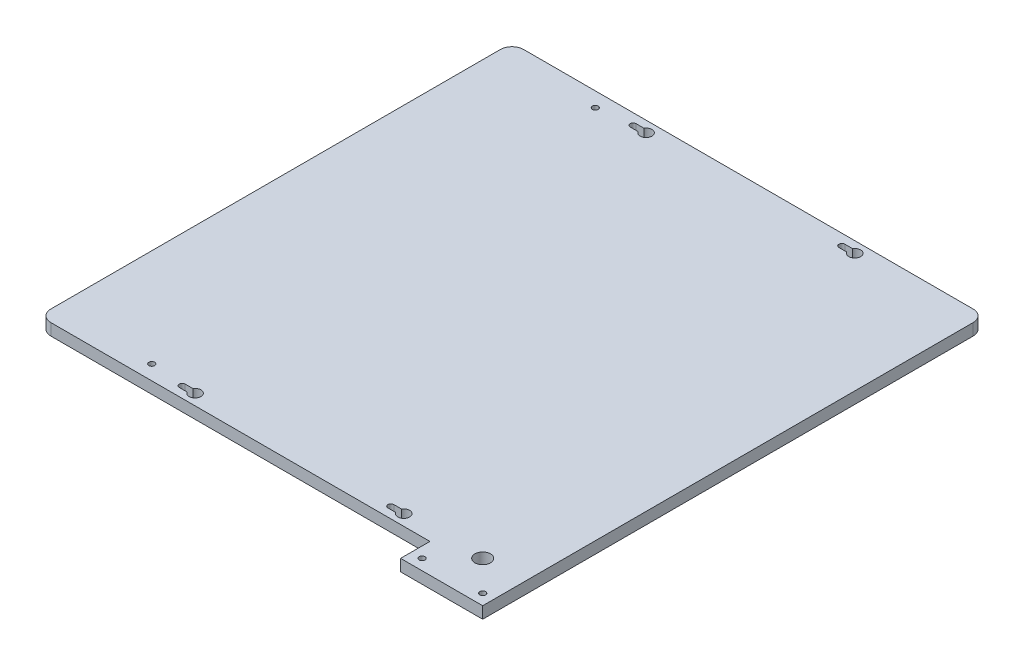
ISO-10303-21;
HEADER;
FILE_DESCRIPTION(('STEP AP214'),'2;1');
FILE_NAME('part.step','',(''),(''),'','','');
FILE_SCHEMA(('AUTOMOTIVE_DESIGN { 1 0 10303 214 1 1 1 1 }'));
ENDSEC;
DATA;
#1=APPLICATION_CONTEXT('core data for automotive mechanical design processes');
#2=APPLICATION_PROTOCOL_DEFINITION('international standard','automotive_design',2000,#1);
#3=PRODUCT_CONTEXT('',#1,'mechanical');
#4=PRODUCT('Part','Part','',(#3));
#5=PRODUCT_RELATED_PRODUCT_CATEGORY('part','',(#4));
#6=PRODUCT_DEFINITION_FORMATION('','',#4);
#7=PRODUCT_DEFINITION_CONTEXT('part definition',#1,'design');
#8=PRODUCT_DEFINITION('design','',#6,#7);
#9=PRODUCT_DEFINITION_SHAPE('','',#8);
#10=(LENGTH_UNIT() NAMED_UNIT(*) SI_UNIT(.MILLI.,.METRE.));
#11=(NAMED_UNIT(*) PLANE_ANGLE_UNIT() SI_UNIT($,.RADIAN.));
#12=(NAMED_UNIT(*) SI_UNIT($,.STERADIAN.) SOLID_ANGLE_UNIT());
#13=UNCERTAINTY_MEASURE_WITH_UNIT(LENGTH_MEASURE(1.E-05),#10,'distance_accuracy_value','');
#14=(GEOMETRIC_REPRESENTATION_CONTEXT(3) GLOBAL_UNCERTAINTY_ASSIGNED_CONTEXT((#13)) GLOBAL_UNIT_ASSIGNED_CONTEXT((#10,
#11,#12)) REPRESENTATION_CONTEXT('',''));
#15=CARTESIAN_POINT('',(0.,0.,0.));
#16=DIRECTION('',(0.,0.,1.));
#17=DIRECTION('',(1.,0.,0.));
#18=AXIS2_PLACEMENT_3D('',#15,#16,#17);
#19=CARTESIAN_POINT('',(0.,-3.,0.));
#20=DIRECTION('',(0.,1.,0.));
#21=DIRECTION('',(0.,0.,1.));
#22=AXIS2_PLACEMENT_3D('',#19,#20,#21);
#23=PLANE('',#22);
#24=DIRECTION('',(1.,0.,0.));
#25=VECTOR('',#24,1.);
#26=CARTESIAN_POINT('',(53.4,-3.,116.9));
#27=LINE('',#26,#25);
#28=CARTESIAN_POINT('',(53.4,-3.,116.9));
#29=VERTEX_POINT('',#28);
#30=CARTESIAN_POINT('',(57.4019237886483,-3.,116.9));
#31=VERTEX_POINT('',#30);
#32=EDGE_CURVE('E251',#29,#31,#27,.T.);
#33=ORIENTED_EDGE('',*,*,#32,.T.);
#34=CARTESIAN_POINT('',(60.,-3.,115.4));
#35=DIRECTION('',(0.,-1.,0.));
#36=DIRECTION('',(0.,0.,-1.));
#37=AXIS2_PLACEMENT_3D('',#34,#35,#36);
#38=CIRCLE('',#37,2.99999999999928);
#39=CARTESIAN_POINT('',(57.4019237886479,-3.,113.899999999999));
#40=VERTEX_POINT('',#39);
#41=EDGE_CURVE('E774',#40,#31,#38,.T.);
#42=ORIENTED_EDGE('',*,*,#41,.F.);
#43=DIRECTION('',(-1.,0.,1.8032451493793E-13));
#44=VECTOR('',#43,1.);
#45=CARTESIAN_POINT('',(57.4019237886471,-3.,113.899999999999));
#46=LINE('',#45,#44);
#47=CARTESIAN_POINT('',(53.4,-3.,113.9));
#48=VERTEX_POINT('',#47);
#49=EDGE_CURVE('E247',#40,#48,#46,.T.);
#50=ORIENTED_EDGE('',*,*,#49,.T.);
#51=CARTESIAN_POINT('',(53.4,-3.,115.4));
#52=DIRECTION('',(0.,1.,0.));
#53=DIRECTION('',(0.,0.,1.));
#54=AXIS2_PLACEMENT_3D('',#51,#52,#53);
#55=CIRCLE('',#54,1.5);
#56=EDGE_CURVE('E260',#48,#29,#55,.T.);
#57=ORIENTED_EDGE('',*,*,#56,.T.);
#58=EDGE_LOOP('',(#33,#42,#50,#57));
#59=FACE_BOUND('',#58,.T.);
#60=DIRECTION('',(1.,0.,0.));
#61=VECTOR('',#60,1.);
#62=CARTESIAN_POINT('',(53.4,-3.,-113.9));
#63=LINE('',#62,#61);
#64=CARTESIAN_POINT('',(53.4,-3.,-113.9));
#65=VERTEX_POINT('',#64);
#66=CARTESIAN_POINT('',(57.4019237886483,-3.,-113.9));
#67=VERTEX_POINT('',#66);
#68=EDGE_CURVE('E303',#65,#67,#63,.T.);
#69=ORIENTED_EDGE('',*,*,#68,.T.);
#70=CARTESIAN_POINT('',(60.,-3.,-115.4));
#71=DIRECTION('',(0.,-1.,0.));
#72=DIRECTION('',(0.,0.,-1.));
#73=AXIS2_PLACEMENT_3D('',#70,#71,#72);
#74=CIRCLE('',#73,2.99999999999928);
#75=CARTESIAN_POINT('',(57.4019237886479,-3.,-116.900000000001));
#76=VERTEX_POINT('',#75);
#77=EDGE_CURVE('E795',#76,#67,#74,.T.);
#78=ORIENTED_EDGE('',*,*,#77,.F.);
#79=DIRECTION('',(-1.,0.,1.8032451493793E-13));
#80=VECTOR('',#79,1.);
#81=CARTESIAN_POINT('',(57.4019237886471,-3.,-116.900000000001));
#82=LINE('',#81,#80);
#83=CARTESIAN_POINT('',(53.4,-3.,-116.9));
#84=VERTEX_POINT('',#83);
#85=EDGE_CURVE('E299',#76,#84,#82,.T.);
#86=ORIENTED_EDGE('',*,*,#85,.T.);
#87=CARTESIAN_POINT('',(53.4,-3.,-115.4));
#88=DIRECTION('',(0.,1.,0.));
#89=DIRECTION('',(0.,0.,1.));
#90=AXIS2_PLACEMENT_3D('',#87,#88,#89);
#91=CIRCLE('',#90,1.5);
#92=EDGE_CURVE('E312',#84,#65,#91,.T.);
#93=ORIENTED_EDGE('',*,*,#92,.T.);
#94=EDGE_LOOP('',(#69,#78,#86,#93));
#95=FACE_BOUND('',#94,.T.);
#96=CARTESIAN_POINT('',(115.5,-3.,130.5));
#97=DIRECTION('',(0.,1.,0.));
#98=DIRECTION('',(0.,0.,1.));
#99=AXIS2_PLACEMENT_3D('',#96,#97,#98);
#100=CIRCLE('',#99,1.5);
#101=CARTESIAN_POINT('',(115.5,-3.,132.));
#102=VERTEX_POINT('',#101);
#103=EDGE_CURVE('E326',#102,#102,#100,.T.);
#104=ORIENTED_EDGE('',*,*,#103,.T.);
#105=EDGE_LOOP('',(#104));
#106=FACE_BOUND('',#105,.T.);
#107=CARTESIAN_POINT('',(84.5,-3.,130.5));
#108=DIRECTION('',(0.,1.,0.));
#109=DIRECTION('',(0.,0.,1.));
#110=AXIS2_PLACEMENT_3D('',#107,#108,#109);
#111=CIRCLE('',#110,1.5);
#112=CARTESIAN_POINT('',(84.5,-3.,132.));
#113=VERTEX_POINT('',#112);
#114=EDGE_CURVE('E329',#113,#113,#111,.T.);
#115=ORIENTED_EDGE('',*,*,#114,.T.);
#116=EDGE_LOOP('',(#115));
#117=FACE_BOUND('',#116,.T.);
#118=DIRECTION('',(-1.,0.,0.));
#119=VECTOR('',#118,1.);
#120=CARTESIAN_POINT('',(0.,-3.,-121.));
#121=LINE('',#120,#119);
#122=CARTESIAN_POINT('',(115.,-3.,-121.));
#123=VERTEX_POINT('',#122);
#124=CARTESIAN_POINT('',(-115.,-3.,-121.));
#125=VERTEX_POINT('',#124);
#126=EDGE_CURVE('E335',#123,#125,#121,.T.);
#127=ORIENTED_EDGE('',*,*,#126,.F.);
#128=CARTESIAN_POINT('',(115.,-3.,-115.));
#129=DIRECTION('',(0.,1.,0.));
#130=DIRECTION('',(0.,0.,1.));
#131=AXIS2_PLACEMENT_3D('',#128,#129,#130);
#132=CIRCLE('',#131,6.);
#133=CARTESIAN_POINT('',(121.,-3.,-115.));
#134=VERTEX_POINT('',#133);
#135=EDGE_CURVE('E410',#123,#134,#132,.F.);
#136=ORIENTED_EDGE('',*,*,#135,.T.);
#137=DIRECTION('',(0.,0.,1.));
#138=VECTOR('',#137,1.);
#139=CARTESIAN_POINT('',(121.,-3.,0.));
#140=LINE('',#139,#138);
#141=CARTESIAN_POINT('',(121.,-3.,136.));
#142=VERTEX_POINT('',#141);
#143=EDGE_CURVE('E333',#134,#142,#140,.T.);
#144=ORIENTED_EDGE('',*,*,#143,.T.);
#145=DIRECTION('',(-1.,0.,0.));
#146=VECTOR('',#145,1.);
#147=CARTESIAN_POINT('',(0.,-3.,136.));
#148=LINE('',#147,#146);
#149=CARTESIAN_POINT('',(79.,-3.,136.));
#150=VERTEX_POINT('',#149);
#151=EDGE_CURVE('E345',#142,#150,#148,.T.);
#152=ORIENTED_EDGE('',*,*,#151,.T.);
#153=DIRECTION('',(0.,0.,1.));
#154=VECTOR('',#153,1.);
#155=CARTESIAN_POINT('',(78.9999999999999,-3.,0.));
#156=LINE('',#155,#154);
#157=CARTESIAN_POINT('',(79.,-3.,121.));
#158=VERTEX_POINT('',#157);
#159=EDGE_CURVE('E342',#158,#150,#156,.T.);
#160=ORIENTED_EDGE('',*,*,#159,.F.);
#161=DIRECTION('',(1.,0.,0.));
#162=VECTOR('',#161,1.);
#163=CARTESIAN_POINT('',(0.,-3.,121.));
#164=LINE('',#163,#162);
#165=CARTESIAN_POINT('',(-115.,-3.,121.));
#166=VERTEX_POINT('',#165);
#167=EDGE_CURVE('E340',#166,#158,#164,.T.);
#168=ORIENTED_EDGE('',*,*,#167,.F.);
#169=CARTESIAN_POINT('',(-115.,-3.,115.));
#170=DIRECTION('',(0.,1.,0.));
#171=DIRECTION('',(0.,0.,1.));
#172=AXIS2_PLACEMENT_3D('',#169,#170,#171);
#173=CIRCLE('',#172,6.);
#174=CARTESIAN_POINT('',(-121.,-3.,115.));
#175=VERTEX_POINT('',#174);
#176=EDGE_CURVE('E52',#166,#175,#173,.F.);
#177=ORIENTED_EDGE('',*,*,#176,.T.);
#178=DIRECTION('',(0.,0.,1.));
#179=VECTOR('',#178,1.);
#180=CARTESIAN_POINT('',(-121.,-3.,0.));
#181=LINE('',#180,#179);
#182=CARTESIAN_POINT('',(-121.,-3.,-115.));
#183=VERTEX_POINT('',#182);
#184=EDGE_CURVE('E338',#183,#175,#181,.T.);
#185=ORIENTED_EDGE('',*,*,#184,.F.);
#186=CARTESIAN_POINT('',(-115.,-3.,-115.));
#187=DIRECTION('',(0.,1.,0.));
#188=DIRECTION('',(0.,0.,1.));
#189=AXIS2_PLACEMENT_3D('',#186,#187,#188);
#190=CIRCLE('',#189,6.);
#191=EDGE_CURVE('E407',#183,#125,#190,.F.);
#192=ORIENTED_EDGE('',*,*,#191,.T.);
#193=EDGE_LOOP('',(#127,#136,#144,#152,#160,#168,#177,#185,#192));
#194=FACE_BOUND('',#193,.T.);
#195=CARTESIAN_POINT('',(100.,-3.,115.));
#196=DIRECTION('',(0.,1.,0.));
#197=DIRECTION('',(0.,0.,1.));
#198=AXIS2_PLACEMENT_3D('',#195,#196,#197);
#199=CIRCLE('',#198,4.00000000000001);
#200=CARTESIAN_POINT('',(100.,-3.,119.));
#201=VERTEX_POINT('',#200);
#202=EDGE_CURVE('E347',#201,#201,#199,.T.);
#203=ORIENTED_EDGE('',*,*,#202,.T.);
#204=EDGE_LOOP('',(#203));
#205=FACE_BOUND('',#204,.T.);
#206=CARTESIAN_POINT('',(-70.85,-3.,-113.5));
#207=DIRECTION('',(0.,1.,0.));
#208=DIRECTION('',(0.,0.,1.));
#209=AXIS2_PLACEMENT_3D('',#206,#207,#208);
#210=CIRCLE('',#209,1.5);
#211=CARTESIAN_POINT('',(-70.85,-3.,-112.));
#212=VERTEX_POINT('',#211);
#213=EDGE_CURVE('E350',#212,#212,#210,.T.);
#214=ORIENTED_EDGE('',*,*,#213,.T.);
#215=EDGE_LOOP('',(#214));
#216=FACE_BOUND('',#215,.T.);
#217=CARTESIAN_POINT('',(-70.85,-3.,113.5));
#218=DIRECTION('',(0.,1.,0.));
#219=DIRECTION('',(0.,0.,1.));
#220=AXIS2_PLACEMENT_3D('',#217,#218,#219);
#221=CIRCLE('',#220,1.5);
#222=CARTESIAN_POINT('',(-70.85,-3.,115.));
#223=VERTEX_POINT('',#222);
#224=EDGE_CURVE('E353',#223,#223,#221,.T.);
#225=ORIENTED_EDGE('',*,*,#224,.T.);
#226=EDGE_LOOP('',(#225));
#227=FACE_BOUND('',#226,.T.);
#228=DIRECTION('',(1.,0.,0.));
#229=VECTOR('',#228,1.);
#230=CARTESIAN_POINT('',(-53.4,-3.,-113.9));
#231=LINE('',#230,#229);
#232=CARTESIAN_POINT('',(-53.4,-3.,-113.9));
#233=VERTEX_POINT('',#232);
#234=CARTESIAN_POINT('',(-49.3980762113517,-3.,-113.9));
#235=VERTEX_POINT('',#234);
#236=EDGE_CURVE('E277',#233,#235,#231,.T.);
#237=ORIENTED_EDGE('',*,*,#236,.T.);
#238=CARTESIAN_POINT('',(-46.8,-3.,-115.4));
#239=DIRECTION('',(0.,-1.,0.));
#240=DIRECTION('',(0.,0.,-1.));
#241=AXIS2_PLACEMENT_3D('',#238,#239,#240);
#242=CIRCLE('',#241,2.99999999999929);
#243=CARTESIAN_POINT('',(-49.3980762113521,-3.,-116.900000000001));
#244=VERTEX_POINT('',#243);
#245=EDGE_CURVE('E787',#244,#235,#242,.T.);
#246=ORIENTED_EDGE('',*,*,#245,.F.);
#247=DIRECTION('',(-1.,0.,1.8032451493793E-13));
#248=VECTOR('',#247,1.);
#249=CARTESIAN_POINT('',(-49.3980762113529,-3.,-116.900000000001));
#250=LINE('',#249,#248);
#251=CARTESIAN_POINT('',(-53.4,-3.,-116.9));
#252=VERTEX_POINT('',#251);
#253=EDGE_CURVE('E273',#244,#252,#250,.T.);
#254=ORIENTED_EDGE('',*,*,#253,.T.);
#255=CARTESIAN_POINT('',(-53.4,-3.,-115.4));
#256=DIRECTION('',(0.,1.,0.));
#257=DIRECTION('',(0.,0.,1.));
#258=AXIS2_PLACEMENT_3D('',#255,#256,#257);
#259=CIRCLE('',#258,1.5);
#260=EDGE_CURVE('E286',#252,#233,#259,.T.);
#261=ORIENTED_EDGE('',*,*,#260,.T.);
#262=EDGE_LOOP('',(#237,#246,#254,#261));
#263=FACE_BOUND('',#262,.T.);
#264=DIRECTION('',(-1.,0.,-1.8032451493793E-13));
#265=VECTOR('',#264,1.);
#266=CARTESIAN_POINT('',(-49.3980762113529,-3.,116.900000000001));
#267=LINE('',#266,#265);
#268=CARTESIAN_POINT('',(-49.3980762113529,-3.,116.900000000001));
#269=VERTEX_POINT('',#268);
#270=CARTESIAN_POINT('',(-53.4,-3.,116.9));
#271=VERTEX_POINT('',#270);
#272=EDGE_CURVE('E222',#269,#271,#267,.T.);
#273=ORIENTED_EDGE('',*,*,#272,.F.);
#274=CARTESIAN_POINT('',(-46.8,-3.,115.4));
#275=DIRECTION('',(0.,-1.,0.));
#276=DIRECTION('',(0.,0.,-1.));
#277=AXIS2_PLACEMENT_3D('',#274,#275,#276);
#278=CIRCLE('',#277,2.99999999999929);
#279=CARTESIAN_POINT('',(-49.3980762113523,-3.,113.9));
#280=VERTEX_POINT('',#279);
#281=EDGE_CURVE('E207',#280,#269,#278,.T.);
#282=ORIENTED_EDGE('',*,*,#281,.F.);
#283=DIRECTION('',(1.,0.,-1.8032451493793E-13));
#284=VECTOR('',#283,1.);
#285=CARTESIAN_POINT('',(-53.4,-3.,113.9));
#286=LINE('',#285,#284);
#287=CARTESIAN_POINT('',(-53.4,-3.,113.9));
#288=VERTEX_POINT('',#287);
#289=EDGE_CURVE('E221',#288,#280,#286,.T.);
#290=ORIENTED_EDGE('',*,*,#289,.F.);
#291=CARTESIAN_POINT('',(-53.4,-3.,115.4));
#292=DIRECTION('',(0.,-1.,0.));
#293=DIRECTION('',(0.,0.,-1.));
#294=AXIS2_PLACEMENT_3D('',#291,#292,#293);
#295=CIRCLE('',#294,1.5);
#296=EDGE_CURVE('E227',#271,#288,#295,.T.);
#297=ORIENTED_EDGE('',*,*,#296,.F.);
#298=EDGE_LOOP('',(#273,#282,#290,#297));
#299=FACE_BOUND('',#298,.T.);
#300=ADVANCED_FACE('F37',(#59,#95,#106,#117,#194,#205,#216,#227,#263,#299),#23,.F.);
#301=CARTESIAN_POINT('',(0.,3.,0.));
#302=DIRECTION('',(0.,1.,0.));
#303=DIRECTION('',(0.,0.,1.));
#304=AXIS2_PLACEMENT_3D('',#301,#302,#303);
#305=PLANE('',#304);
#306=CARTESIAN_POINT('',(-46.8,3.,115.4));
#307=DIRECTION('',(0.,-1.,0.));
#308=DIRECTION('',(0.,0.,-1.));
#309=AXIS2_PLACEMENT_3D('',#306,#307,#308);
#310=CIRCLE('',#309,2.99999999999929);
#311=CARTESIAN_POINT('',(-49.3980762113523,3.,113.9));
#312=VERTEX_POINT('',#311);
#313=CARTESIAN_POINT('',(-49.3980762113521,3.,116.900000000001));
#314=VERTEX_POINT('',#313);
#315=EDGE_CURVE('E210',#312,#314,#310,.T.);
#316=ORIENTED_EDGE('',*,*,#315,.T.);
#317=DIRECTION('',(-1.,0.,-1.8032451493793E-13));
#318=VECTOR('',#317,1.);
#319=CARTESIAN_POINT('',(-49.3980762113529,3.,116.900000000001));
#320=LINE('',#319,#318);
#321=CARTESIAN_POINT('',(-53.4,3.,116.9));
#322=VERTEX_POINT('',#321);
#323=EDGE_CURVE('E231',#314,#322,#320,.T.);
#324=ORIENTED_EDGE('',*,*,#323,.T.);
#325=CARTESIAN_POINT('',(-53.4,3.,115.4));
#326=DIRECTION('',(0.,-1.,0.));
#327=DIRECTION('',(0.,0.,-1.));
#328=AXIS2_PLACEMENT_3D('',#325,#326,#327);
#329=CIRCLE('',#328,1.5);
#330=CARTESIAN_POINT('',(-53.4,3.,113.9));
#331=VERTEX_POINT('',#330);
#332=EDGE_CURVE('E235',#322,#331,#329,.T.);
#333=ORIENTED_EDGE('',*,*,#332,.T.);
#334=DIRECTION('',(1.,0.,-1.8032451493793E-13));
#335=VECTOR('',#334,1.);
#336=CARTESIAN_POINT('',(-53.4,3.,113.9));
#337=LINE('',#336,#335);
#338=EDGE_CURVE('E238',#331,#312,#337,.T.);
#339=ORIENTED_EDGE('',*,*,#338,.T.);
#340=EDGE_LOOP('',(#316,#324,#333,#339));
#341=FACE_BOUND('',#340,.T.);
#342=CARTESIAN_POINT('',(60.,3.,115.4));
#343=DIRECTION('',(0.,-1.,0.));
#344=DIRECTION('',(0.,0.,-1.));
#345=AXIS2_PLACEMENT_3D('',#342,#343,#344);
#346=CIRCLE('',#345,2.99999999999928);
#347=CARTESIAN_POINT('',(57.4019237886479,3.,113.899999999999));
#348=VERTEX_POINT('',#347);
#349=CARTESIAN_POINT('',(57.4019237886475,3.,116.9));
#350=VERTEX_POINT('',#349);
#351=EDGE_CURVE('E776',#348,#350,#346,.T.);
#352=ORIENTED_EDGE('',*,*,#351,.T.);
#353=DIRECTION('',(1.,0.,0.));
#354=VECTOR('',#353,1.);
#355=CARTESIAN_POINT('',(53.4,3.,116.9));
#356=LINE('',#355,#354);
#357=CARTESIAN_POINT('',(53.4,3.,116.9));
#358=VERTEX_POINT('',#357);
#359=EDGE_CURVE('E254',#358,#350,#356,.T.);
#360=ORIENTED_EDGE('',*,*,#359,.F.);
#361=CARTESIAN_POINT('',(53.4,3.,115.4));
#362=DIRECTION('',(0.,1.,0.));
#363=DIRECTION('',(0.,0.,1.));
#364=AXIS2_PLACEMENT_3D('',#361,#362,#363);
#365=CIRCLE('',#364,1.5);
#366=CARTESIAN_POINT('',(53.4,3.,113.9));
#367=VERTEX_POINT('',#366);
#368=EDGE_CURVE('E250',#367,#358,#365,.T.);
#369=ORIENTED_EDGE('',*,*,#368,.F.);
#370=DIRECTION('',(-1.,0.,1.8032451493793E-13));
#371=VECTOR('',#370,1.);
#372=CARTESIAN_POINT('',(57.4019237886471,3.,113.899999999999));
#373=LINE('',#372,#371);
#374=EDGE_CURVE('E248',#348,#367,#373,.T.);
#375=ORIENTED_EDGE('',*,*,#374,.F.);
#376=EDGE_LOOP('',(#352,#360,#369,#375));
#377=FACE_BOUND('',#376,.T.);
#378=CARTESIAN_POINT('',(-46.8,3.,-115.4));
#379=DIRECTION('',(0.,-1.,0.));
#380=DIRECTION('',(0.,0.,-1.));
#381=AXIS2_PLACEMENT_3D('',#378,#379,#380);
#382=CIRCLE('',#381,2.99999999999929);
#383=CARTESIAN_POINT('',(-49.3980762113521,3.,-116.900000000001));
#384=VERTEX_POINT('',#383);
#385=CARTESIAN_POINT('',(-49.3980762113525,3.,-113.9));
#386=VERTEX_POINT('',#385);
#387=EDGE_CURVE('E789',#384,#386,#382,.T.);
#388=ORIENTED_EDGE('',*,*,#387,.T.);
#389=DIRECTION('',(1.,0.,0.));
#390=VECTOR('',#389,1.);
#391=CARTESIAN_POINT('',(-53.4,3.,-113.9));
#392=LINE('',#391,#390);
#393=CARTESIAN_POINT('',(-53.4,3.,-113.9));
#394=VERTEX_POINT('',#393);
#395=EDGE_CURVE('E280',#394,#386,#392,.T.);
#396=ORIENTED_EDGE('',*,*,#395,.F.);
#397=CARTESIAN_POINT('',(-53.4,3.,-115.4));
#398=DIRECTION('',(0.,1.,0.));
#399=DIRECTION('',(0.,0.,1.));
#400=AXIS2_PLACEMENT_3D('',#397,#398,#399);
#401=CIRCLE('',#400,1.5);
#402=CARTESIAN_POINT('',(-53.4,3.,-116.9));
#403=VERTEX_POINT('',#402);
#404=EDGE_CURVE('E276',#403,#394,#401,.T.);
#405=ORIENTED_EDGE('',*,*,#404,.F.);
#406=DIRECTION('',(-1.,0.,1.8032451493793E-13));
#407=VECTOR('',#406,1.);
#408=CARTESIAN_POINT('',(-49.3980762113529,3.,-116.900000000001));
#409=LINE('',#408,#407);
#410=EDGE_CURVE('E274',#384,#403,#409,.T.);
#411=ORIENTED_EDGE('',*,*,#410,.F.);
#412=EDGE_LOOP('',(#388,#396,#405,#411));
#413=FACE_BOUND('',#412,.T.);
#414=CARTESIAN_POINT('',(60.,3.,-115.4));
#415=DIRECTION('',(0.,-1.,0.));
#416=DIRECTION('',(0.,0.,-1.));
#417=AXIS2_PLACEMENT_3D('',#414,#415,#416);
#418=CIRCLE('',#417,2.99999999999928);
#419=CARTESIAN_POINT('',(57.4019237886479,3.,-116.900000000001));
#420=VERTEX_POINT('',#419);
#421=CARTESIAN_POINT('',(57.4019237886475,3.,-113.9));
#422=VERTEX_POINT('',#421);
#423=EDGE_CURVE('E239',#420,#422,#418,.T.);
#424=ORIENTED_EDGE('',*,*,#423,.T.);
#425=DIRECTION('',(1.,0.,0.));
#426=VECTOR('',#425,1.);
#427=CARTESIAN_POINT('',(53.4,3.,-113.9));
#428=LINE('',#427,#426);
#429=CARTESIAN_POINT('',(53.4,3.,-113.9));
#430=VERTEX_POINT('',#429);
#431=EDGE_CURVE('E306',#430,#422,#428,.T.);
#432=ORIENTED_EDGE('',*,*,#431,.F.);
#433=CARTESIAN_POINT('',(53.4,3.,-115.4));
#434=DIRECTION('',(0.,1.,0.));
#435=DIRECTION('',(0.,0.,1.));
#436=AXIS2_PLACEMENT_3D('',#433,#434,#435);
#437=CIRCLE('',#436,1.5);
#438=CARTESIAN_POINT('',(53.4,3.,-116.9));
#439=VERTEX_POINT('',#438);
#440=EDGE_CURVE('E302',#439,#430,#437,.T.);
#441=ORIENTED_EDGE('',*,*,#440,.F.);
#442=DIRECTION('',(-1.,0.,1.8032451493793E-13));
#443=VECTOR('',#442,1.);
#444=CARTESIAN_POINT('',(57.4019237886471,3.,-116.900000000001));
#445=LINE('',#444,#443);
#446=EDGE_CURVE('E300',#420,#439,#445,.T.);
#447=ORIENTED_EDGE('',*,*,#446,.F.);
#448=EDGE_LOOP('',(#424,#432,#441,#447));
#449=FACE_BOUND('',#448,.T.);
#450=CARTESIAN_POINT('',(115.5,3.,130.5));
#451=DIRECTION('',(0.,1.,0.));
#452=DIRECTION('',(0.,0.,1.));
#453=AXIS2_PLACEMENT_3D('',#450,#451,#452);
#454=CIRCLE('',#453,1.5);
#455=CARTESIAN_POINT('',(115.5,3.,132.));
#456=VERTEX_POINT('',#455);
#457=EDGE_CURVE('E325',#456,#456,#454,.T.);
#458=ORIENTED_EDGE('',*,*,#457,.F.);
#459=EDGE_LOOP('',(#458));
#460=FACE_BOUND('',#459,.T.);
#461=CARTESIAN_POINT('',(84.5,3.,130.5));
#462=DIRECTION('',(0.,1.,0.));
#463=DIRECTION('',(0.,0.,1.));
#464=AXIS2_PLACEMENT_3D('',#461,#462,#463);
#465=CIRCLE('',#464,1.5);
#466=CARTESIAN_POINT('',(84.5,3.,132.));
#467=VERTEX_POINT('',#466);
#468=EDGE_CURVE('E359',#467,#467,#465,.T.);
#469=ORIENTED_EDGE('',*,*,#468,.F.);
#470=EDGE_LOOP('',(#469));
#471=FACE_BOUND('',#470,.T.);
#472=DIRECTION('',(0.,0.,1.));
#473=VECTOR('',#472,1.);
#474=CARTESIAN_POINT('',(121.,3.,0.));
#475=LINE('',#474,#473);
#476=CARTESIAN_POINT('',(121.,3.,-115.));
#477=VERTEX_POINT('',#476);
#478=CARTESIAN_POINT('',(121.,3.,136.));
#479=VERTEX_POINT('',#478);
#480=EDGE_CURVE('E362',#477,#479,#475,.T.);
#481=ORIENTED_EDGE('',*,*,#480,.F.);
#482=CARTESIAN_POINT('',(115.,3.,-115.));
#483=DIRECTION('',(0.,1.,0.));
#484=DIRECTION('',(0.,0.,1.));
#485=AXIS2_PLACEMENT_3D('',#482,#483,#484);
#486=CIRCLE('',#485,6.);
#487=CARTESIAN_POINT('',(115.,3.,-121.));
#488=VERTEX_POINT('',#487);
#489=EDGE_CURVE('E400',#477,#488,#486,.T.);
#490=ORIENTED_EDGE('',*,*,#489,.T.);
#491=DIRECTION('',(-1.,0.,0.));
#492=VECTOR('',#491,1.);
#493=CARTESIAN_POINT('',(0.,3.,-121.));
#494=LINE('',#493,#492);
#495=CARTESIAN_POINT('',(-115.,3.,-121.));
#496=VERTEX_POINT('',#495);
#497=EDGE_CURVE('E364',#488,#496,#494,.T.);
#498=ORIENTED_EDGE('',*,*,#497,.T.);
#499=CARTESIAN_POINT('',(-115.,3.,-115.));
#500=DIRECTION('',(0.,1.,0.));
#501=DIRECTION('',(0.,0.,1.));
#502=AXIS2_PLACEMENT_3D('',#499,#500,#501);
#503=CIRCLE('',#502,6.);
#504=CARTESIAN_POINT('',(-121.,3.,-115.));
#505=VERTEX_POINT('',#504);
#506=EDGE_CURVE('E396',#496,#505,#503,.T.);
#507=ORIENTED_EDGE('',*,*,#506,.T.);
#508=DIRECTION('',(0.,0.,1.));
#509=VECTOR('',#508,1.);
#510=CARTESIAN_POINT('',(-121.,3.,0.));
#511=LINE('',#510,#509);
#512=CARTESIAN_POINT('',(-121.,3.,115.));
#513=VERTEX_POINT('',#512);
#514=EDGE_CURVE('E367',#505,#513,#511,.T.);
#515=ORIENTED_EDGE('',*,*,#514,.T.);
#516=CARTESIAN_POINT('',(-115.,3.,115.));
#517=DIRECTION('',(0.,1.,0.));
#518=DIRECTION('',(0.,0.,1.));
#519=AXIS2_PLACEMENT_3D('',#516,#517,#518);
#520=CIRCLE('',#519,6.);
#521=CARTESIAN_POINT('',(-115.,3.,121.));
#522=VERTEX_POINT('',#521);
#523=EDGE_CURVE('E398',#513,#522,#520,.T.);
#524=ORIENTED_EDGE('',*,*,#523,.T.);
#525=DIRECTION('',(1.,0.,0.));
#526=VECTOR('',#525,1.);
#527=CARTESIAN_POINT('',(0.,3.,121.));
#528=LINE('',#527,#526);
#529=CARTESIAN_POINT('',(79.,3.,121.));
#530=VERTEX_POINT('',#529);
#531=EDGE_CURVE('E370',#522,#530,#528,.T.);
#532=ORIENTED_EDGE('',*,*,#531,.T.);
#533=DIRECTION('',(0.,0.,1.));
#534=VECTOR('',#533,1.);
#535=CARTESIAN_POINT('',(78.9999999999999,3.,0.));
#536=LINE('',#535,#534);
#537=CARTESIAN_POINT('',(79.,3.,136.));
#538=VERTEX_POINT('',#537);
#539=EDGE_CURVE('E372',#530,#538,#536,.T.);
#540=ORIENTED_EDGE('',*,*,#539,.T.);
#541=DIRECTION('',(-1.,0.,0.));
#542=VECTOR('',#541,1.);
#543=CARTESIAN_POINT('',(0.,3.,136.));
#544=LINE('',#543,#542);
#545=EDGE_CURVE('E375',#479,#538,#544,.T.);
#546=ORIENTED_EDGE('',*,*,#545,.F.);
#547=EDGE_LOOP('',(#481,#490,#498,#507,#515,#524,#532,#540,#546));
#548=FACE_BOUND('',#547,.T.);
#549=CARTESIAN_POINT('',(100.,3.,115.));
#550=DIRECTION('',(0.,1.,0.));
#551=DIRECTION('',(0.,0.,1.));
#552=AXIS2_PLACEMENT_3D('',#549,#550,#551);
#553=CIRCLE('',#552,4.00000000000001);
#554=CARTESIAN_POINT('',(100.,3.,119.));
#555=VERTEX_POINT('',#554);
#556=EDGE_CURVE('E378',#555,#555,#553,.T.);
#557=ORIENTED_EDGE('',*,*,#556,.F.);
#558=EDGE_LOOP('',(#557));
#559=FACE_BOUND('',#558,.T.);
#560=CARTESIAN_POINT('',(-70.85,3.,-113.5));
#561=DIRECTION('',(0.,1.,0.));
#562=DIRECTION('',(0.,0.,1.));
#563=AXIS2_PLACEMENT_3D('',#560,#561,#562);
#564=CIRCLE('',#563,1.5);
#565=CARTESIAN_POINT('',(-70.85,3.,-112.));
#566=VERTEX_POINT('',#565);
#567=EDGE_CURVE('E381',#566,#566,#564,.T.);
#568=ORIENTED_EDGE('',*,*,#567,.F.);
#569=EDGE_LOOP('',(#568));
#570=FACE_BOUND('',#569,.T.);
#571=CARTESIAN_POINT('',(-70.85,3.,113.5));
#572=DIRECTION('',(0.,1.,0.));
#573=DIRECTION('',(0.,0.,1.));
#574=AXIS2_PLACEMENT_3D('',#571,#572,#573);
#575=CIRCLE('',#574,1.5);
#576=CARTESIAN_POINT('',(-70.85,3.,115.));
#577=VERTEX_POINT('',#576);
#578=EDGE_CURVE('E330',#577,#577,#575,.T.);
#579=ORIENTED_EDGE('',*,*,#578,.F.);
#580=EDGE_LOOP('',(#579));
#581=FACE_BOUND('',#580,.T.);
#582=ADVANCED_FACE('F418',(#341,#377,#413,#449,#460,#471,#548,#559,#570,#581),#305,.T.);
#583=CARTESIAN_POINT('',(121.,-3.,0.));
#584=DIRECTION('',(-1.,0.,0.));
#585=DIRECTION('',(0.,0.,1.));
#586=AXIS2_PLACEMENT_3D('',#583,#584,#585);
#587=PLANE('',#586);
#588=ORIENTED_EDGE('',*,*,#143,.F.);
#589=DIRECTION('',(0.,1.,0.));
#590=VECTOR('',#589,1.);
#591=CARTESIAN_POINT('',(121.,3.,-115.));
#592=LINE('',#591,#590);
#593=EDGE_CURVE('E389',#134,#477,#592,.T.);
#594=ORIENTED_EDGE('',*,*,#593,.T.);
#595=ORIENTED_EDGE('',*,*,#480,.T.);
#596=DIRECTION('',(0.,1.,0.));
#597=VECTOR('',#596,1.);
#598=CARTESIAN_POINT('',(121.,-3.,136.));
#599=LINE('',#598,#597);
#600=EDGE_CURVE('E386',#142,#479,#599,.T.);
#601=ORIENTED_EDGE('',*,*,#600,.F.);
#602=EDGE_LOOP('',(#588,#594,#595,#601));
#603=FACE_BOUND('',#602,.T.);
#604=ADVANCED_FACE('F436',(#603),#587,.F.);
#605=CARTESIAN_POINT('',(0.,-3.,136.));
#606=DIRECTION('',(0.,0.,-1.));
#607=DIRECTION('',(-1.,0.,0.));
#608=AXIS2_PLACEMENT_3D('',#605,#606,#607);
#609=PLANE('',#608);
#610=ORIENTED_EDGE('',*,*,#545,.T.);
#611=DIRECTION('',(0.,1.,0.));
#612=VECTOR('',#611,1.);
#613=CARTESIAN_POINT('',(79.,-3.,136.));
#614=LINE('',#613,#612);
#615=EDGE_CURVE('E390',#150,#538,#614,.T.);
#616=ORIENTED_EDGE('',*,*,#615,.F.);
#617=ORIENTED_EDGE('',*,*,#151,.F.);
#618=ORIENTED_EDGE('',*,*,#600,.T.);
#619=EDGE_LOOP('',(#610,#616,#617,#618));
#620=FACE_BOUND('',#619,.T.);
#621=ADVANCED_FACE('F443',(#620),#609,.F.);
#622=CARTESIAN_POINT('',(78.9999999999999,-3.,0.));
#623=DIRECTION('',(-1.,0.,0.));
#624=DIRECTION('',(0.,0.,1.));
#625=AXIS2_PLACEMENT_3D('',#622,#623,#624);
#626=PLANE('',#625);
#627=ORIENTED_EDGE('',*,*,#539,.F.);
#628=DIRECTION('',(0.,1.,0.));
#629=VECTOR('',#628,1.);
#630=CARTESIAN_POINT('',(79.,-3.,121.));
#631=LINE('',#630,#629);
#632=EDGE_CURVE('E356',#158,#530,#631,.T.);
#633=ORIENTED_EDGE('',*,*,#632,.F.);
#634=ORIENTED_EDGE('',*,*,#159,.T.);
#635=ORIENTED_EDGE('',*,*,#615,.T.);
#636=EDGE_LOOP('',(#627,#633,#634,#635));
#637=FACE_BOUND('',#636,.T.);
#638=ADVANCED_FACE('F447',(#637),#626,.T.);
#639=CARTESIAN_POINT('',(0.,-3.,121.));
#640=DIRECTION('',(0.,0.,1.));
#641=DIRECTION('',(1.,0.,0.));
#642=AXIS2_PLACEMENT_3D('',#639,#640,#641);
#643=PLANE('',#642);
#644=ORIENTED_EDGE('',*,*,#531,.F.);
#645=DIRECTION('',(0.,1.,0.));
#646=VECTOR('',#645,1.);
#647=CARTESIAN_POINT('',(-115.,-3.,121.));
#648=LINE('',#647,#646);
#649=EDGE_CURVE('E11',#522,#166,#648,.F.);
#650=ORIENTED_EDGE('',*,*,#649,.T.);
#651=ORIENTED_EDGE('',*,*,#167,.T.);
#652=ORIENTED_EDGE('',*,*,#632,.T.);
#653=EDGE_LOOP('',(#644,#650,#651,#652));
#654=FACE_BOUND('',#653,.T.);
#655=ADVANCED_FACE('F449',(#654),#643,.T.);
#656=CARTESIAN_POINT('',(-121.,-3.,0.));
#657=DIRECTION('',(-1.,0.,0.));
#658=DIRECTION('',(0.,0.,1.));
#659=AXIS2_PLACEMENT_3D('',#656,#657,#658);
#660=PLANE('',#659);
#661=ORIENTED_EDGE('',*,*,#184,.T.);
#662=DIRECTION('',(0.,1.,0.));
#663=VECTOR('',#662,1.);
#664=CARTESIAN_POINT('',(-121.,-3.,115.));
#665=LINE('',#664,#663);
#666=EDGE_CURVE('E45',#175,#513,#665,.T.);
#667=ORIENTED_EDGE('',*,*,#666,.T.);
#668=ORIENTED_EDGE('',*,*,#514,.F.);
#669=DIRECTION('',(0.,1.,0.));
#670=VECTOR('',#669,1.);
#671=CARTESIAN_POINT('',(-121.,-3.,-115.));
#672=LINE('',#671,#670);
#673=EDGE_CURVE('E59',#505,#183,#672,.F.);
#674=ORIENTED_EDGE('',*,*,#673,.T.);
#675=EDGE_LOOP('',(#661,#667,#668,#674));
#676=FACE_BOUND('',#675,.T.);
#677=ADVANCED_FACE('F414',(#676),#660,.T.);
#678=CARTESIAN_POINT('',(-70.85,-3.,-113.5));
#679=DIRECTION('',(0.,1.,0.));
#680=DIRECTION('',(0.,0.,1.));
#681=AXIS2_PLACEMENT_3D('',#678,#679,#680);
#682=CYLINDRICAL_SURFACE('',#681,1.5);
#683=ORIENTED_EDGE('',*,*,#213,.F.);
#684=EDGE_LOOP('',(#683));
#685=FACE_BOUND('',#684,.T.);
#686=ORIENTED_EDGE('',*,*,#567,.T.);
#687=EDGE_LOOP('',(#686));
#688=FACE_BOUND('',#687,.T.);
#689=ADVANCED_FACE('F476',(#685,#688),#682,.F.);
#690=CARTESIAN_POINT('',(100.,-3.,115.));
#691=DIRECTION('',(0.,1.,0.));
#692=DIRECTION('',(0.,0.,1.));
#693=AXIS2_PLACEMENT_3D('',#690,#691,#692);
#694=CYLINDRICAL_SURFACE('',#693,4.00000000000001);
#695=ORIENTED_EDGE('',*,*,#202,.F.);
#696=EDGE_LOOP('',(#695));
#697=FACE_BOUND('',#696,.T.);
#698=ORIENTED_EDGE('',*,*,#556,.T.);
#699=EDGE_LOOP('',(#698));
#700=FACE_BOUND('',#699,.T.);
#701=ADVANCED_FACE('F479',(#697,#700),#694,.F.);
#702=CARTESIAN_POINT('',(0.,-3.,-121.));
#703=DIRECTION('',(0.,0.,-1.));
#704=DIRECTION('',(-1.,0.,0.));
#705=AXIS2_PLACEMENT_3D('',#702,#703,#704);
#706=PLANE('',#705);
#707=ORIENTED_EDGE('',*,*,#497,.F.);
#708=DIRECTION('',(0.,1.,0.));
#709=VECTOR('',#708,1.);
#710=CARTESIAN_POINT('',(115.,-3.,-121.));
#711=LINE('',#710,#709);
#712=EDGE_CURVE('E405',#488,#123,#711,.F.);
#713=ORIENTED_EDGE('',*,*,#712,.T.);
#714=ORIENTED_EDGE('',*,*,#126,.T.);
#715=DIRECTION('',(0.,1.,0.));
#716=VECTOR('',#715,1.);
#717=CARTESIAN_POINT('',(-115.,-3.,-121.));
#718=LINE('',#717,#716);
#719=EDGE_CURVE('E402',#125,#496,#718,.T.);
#720=ORIENTED_EDGE('',*,*,#719,.T.);
#721=EDGE_LOOP('',(#707,#713,#714,#720));
#722=FACE_BOUND('',#721,.T.);
#723=ADVANCED_FACE('F426',(#722),#706,.T.);
#724=CARTESIAN_POINT('',(84.5,-3.,130.5));
#725=DIRECTION('',(0.,1.,0.));
#726=DIRECTION('',(0.,0.,1.));
#727=AXIS2_PLACEMENT_3D('',#724,#725,#726);
#728=CYLINDRICAL_SURFACE('',#727,1.5);
#729=ORIENTED_EDGE('',*,*,#114,.F.);
#730=EDGE_LOOP('',(#729));
#731=FACE_BOUND('',#730,.T.);
#732=ORIENTED_EDGE('',*,*,#468,.T.);
#733=EDGE_LOOP('',(#732));
#734=FACE_BOUND('',#733,.T.);
#735=ADVANCED_FACE('F494',(#731,#734),#728,.F.);
#736=CARTESIAN_POINT('',(115.5,-3.,130.5));
#737=DIRECTION('',(0.,1.,0.));
#738=DIRECTION('',(0.,0.,1.));
#739=AXIS2_PLACEMENT_3D('',#736,#737,#738);
#740=CYLINDRICAL_SURFACE('',#739,1.5);
#741=ORIENTED_EDGE('',*,*,#103,.F.);
#742=EDGE_LOOP('',(#741));
#743=FACE_BOUND('',#742,.T.);
#744=ORIENTED_EDGE('',*,*,#457,.T.);
#745=EDGE_LOOP('',(#744));
#746=FACE_BOUND('',#745,.T.);
#747=ADVANCED_FACE('F474',(#743,#746),#740,.F.);
#748=CARTESIAN_POINT('',(-70.85,-3.,113.5));
#749=DIRECTION('',(0.,1.,0.));
#750=DIRECTION('',(0.,0.,1.));
#751=AXIS2_PLACEMENT_3D('',#748,#749,#750);
#752=CYLINDRICAL_SURFACE('',#751,1.5);
#753=ORIENTED_EDGE('',*,*,#224,.F.);
#754=EDGE_LOOP('',(#753));
#755=FACE_BOUND('',#754,.T.);
#756=ORIENTED_EDGE('',*,*,#578,.T.);
#757=EDGE_LOOP('',(#756));
#758=FACE_BOUND('',#757,.T.);
#759=ADVANCED_FACE('F471',(#755,#758),#752,.F.);
#760=CARTESIAN_POINT('',(57.4019237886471,3.,-116.900000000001));
#761=DIRECTION('',(1.8032451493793E-13,0.,1.));
#762=DIRECTION('',(1.,0.,-1.8032451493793E-13));
#763=AXIS2_PLACEMENT_3D('',#760,#761,#762);
#764=PLANE('',#763);
#765=ORIENTED_EDGE('',*,*,#85,.F.);
#766=DIRECTION('',(0.,-1.,0.));
#767=VECTOR('',#766,1.);
#768=CARTESIAN_POINT('',(57.4019237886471,3.,-116.900000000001));
#769=LINE('',#768,#767);
#770=EDGE_CURVE('E323',#420,#76,#769,.T.);
#771=ORIENTED_EDGE('',*,*,#770,.F.);
#772=ORIENTED_EDGE('',*,*,#446,.T.);
#773=DIRECTION('',(0.,-1.,0.));
#774=VECTOR('',#773,1.);
#775=CARTESIAN_POINT('',(53.4,3.,-116.9));
#776=LINE('',#775,#774);
#777=EDGE_CURVE('E321',#439,#84,#776,.T.);
#778=ORIENTED_EDGE('',*,*,#777,.T.);
#779=EDGE_LOOP('',(#765,#771,#772,#778));
#780=FACE_BOUND('',#779,.T.);
#781=ADVANCED_FACE('F468',(#780),#764,.T.);
#782=CARTESIAN_POINT('',(53.4,3.,-115.4));
#783=DIRECTION('',(0.,-1.,0.));
#784=DIRECTION('',(0.,0.,-1.));
#785=AXIS2_PLACEMENT_3D('',#782,#783,#784);
#786=CYLINDRICAL_SURFACE('',#785,1.5);
#787=ORIENTED_EDGE('',*,*,#92,.F.);
#788=ORIENTED_EDGE('',*,*,#777,.F.);
#789=ORIENTED_EDGE('',*,*,#440,.T.);
#790=DIRECTION('',(0.,-1.,0.));
#791=VECTOR('',#790,1.);
#792=CARTESIAN_POINT('',(53.4,3.,-113.9));
#793=LINE('',#792,#791);
#794=EDGE_CURVE('E319',#430,#65,#793,.T.);
#795=ORIENTED_EDGE('',*,*,#794,.T.);
#796=EDGE_LOOP('',(#787,#788,#789,#795));
#797=FACE_BOUND('',#796,.T.);
#798=ADVANCED_FACE('F527',(#797),#786,.F.);
#799=CARTESIAN_POINT('',(53.4,3.,-113.9));
#800=DIRECTION('',(0.,0.,-1.));
#801=DIRECTION('',(-1.,0.,0.));
#802=AXIS2_PLACEMENT_3D('',#799,#800,#801);
#803=PLANE('',#802);
#804=ORIENTED_EDGE('',*,*,#68,.F.);
#805=ORIENTED_EDGE('',*,*,#794,.F.);
#806=ORIENTED_EDGE('',*,*,#431,.T.);
#807=DIRECTION('',(0.,-1.,0.));
#808=VECTOR('',#807,1.);
#809=CARTESIAN_POINT('',(57.4019237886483,3.,-113.9));
#810=LINE('',#809,#808);
#811=EDGE_CURVE('E309',#422,#67,#810,.T.);
#812=ORIENTED_EDGE('',*,*,#811,.T.);
#813=EDGE_LOOP('',(#804,#805,#806,#812));
#814=FACE_BOUND('',#813,.T.);
#815=ADVANCED_FACE('F535',(#814),#803,.T.);
#816=CARTESIAN_POINT('',(-49.3980762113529,3.,-116.900000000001));
#817=DIRECTION('',(1.8032451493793E-13,0.,1.));
#818=DIRECTION('',(1.,0.,-1.8032451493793E-13));
#819=AXIS2_PLACEMENT_3D('',#816,#817,#818);
#820=PLANE('',#819);
#821=ORIENTED_EDGE('',*,*,#253,.F.);
#822=DIRECTION('',(0.,-1.,0.));
#823=VECTOR('',#822,1.);
#824=CARTESIAN_POINT('',(-49.3980762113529,3.,-116.900000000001));
#825=LINE('',#824,#823);
#826=EDGE_CURVE('E297',#384,#244,#825,.T.);
#827=ORIENTED_EDGE('',*,*,#826,.F.);
#828=ORIENTED_EDGE('',*,*,#410,.T.);
#829=DIRECTION('',(0.,-1.,0.));
#830=VECTOR('',#829,1.);
#831=CARTESIAN_POINT('',(-53.4,3.,-116.9));
#832=LINE('',#831,#830);
#833=EDGE_CURVE('E295',#403,#252,#832,.T.);
#834=ORIENTED_EDGE('',*,*,#833,.T.);
#835=EDGE_LOOP('',(#821,#827,#828,#834));
#836=FACE_BOUND('',#835,.T.);
#837=ADVANCED_FACE('F542',(#836),#820,.T.);
#838=CARTESIAN_POINT('',(-53.4,3.,-115.4));
#839=DIRECTION('',(0.,-1.,0.));
#840=DIRECTION('',(0.,0.,-1.));
#841=AXIS2_PLACEMENT_3D('',#838,#839,#840);
#842=CYLINDRICAL_SURFACE('',#841,1.5);
#843=ORIENTED_EDGE('',*,*,#260,.F.);
#844=ORIENTED_EDGE('',*,*,#833,.F.);
#845=ORIENTED_EDGE('',*,*,#404,.T.);
#846=DIRECTION('',(0.,-1.,0.));
#847=VECTOR('',#846,1.);
#848=CARTESIAN_POINT('',(-53.4,3.,-113.9));
#849=LINE('',#848,#847);
#850=EDGE_CURVE('E293',#394,#233,#849,.T.);
#851=ORIENTED_EDGE('',*,*,#850,.T.);
#852=EDGE_LOOP('',(#843,#844,#845,#851));
#853=FACE_BOUND('',#852,.T.);
#854=ADVANCED_FACE('F551',(#853),#842,.F.);
#855=CARTESIAN_POINT('',(-53.4,3.,-113.9));
#856=DIRECTION('',(0.,0.,-1.));
#857=DIRECTION('',(-1.,0.,0.));
#858=AXIS2_PLACEMENT_3D('',#855,#856,#857);
#859=PLANE('',#858);
#860=ORIENTED_EDGE('',*,*,#236,.F.);
#861=ORIENTED_EDGE('',*,*,#850,.F.);
#862=ORIENTED_EDGE('',*,*,#395,.T.);
#863=DIRECTION('',(0.,-1.,0.));
#864=VECTOR('',#863,1.);
#865=CARTESIAN_POINT('',(-49.3980762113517,3.,-113.9));
#866=LINE('',#865,#864);
#867=EDGE_CURVE('E283',#386,#235,#866,.T.);
#868=ORIENTED_EDGE('',*,*,#867,.T.);
#869=EDGE_LOOP('',(#860,#861,#862,#868));
#870=FACE_BOUND('',#869,.T.);
#871=ADVANCED_FACE('F559',(#870),#859,.T.);
#872=CARTESIAN_POINT('',(57.4019237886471,3.,113.899999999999));
#873=DIRECTION('',(1.8032451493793E-13,0.,1.));
#874=DIRECTION('',(1.,0.,-1.8032451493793E-13));
#875=AXIS2_PLACEMENT_3D('',#872,#873,#874);
#876=PLANE('',#875);
#877=ORIENTED_EDGE('',*,*,#49,.F.);
#878=DIRECTION('',(0.,-1.,0.));
#879=VECTOR('',#878,1.);
#880=CARTESIAN_POINT('',(57.4019237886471,3.,113.899999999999));
#881=LINE('',#880,#879);
#882=EDGE_CURVE('E271',#348,#40,#881,.T.);
#883=ORIENTED_EDGE('',*,*,#882,.F.);
#884=ORIENTED_EDGE('',*,*,#374,.T.);
#885=DIRECTION('',(0.,-1.,0.));
#886=VECTOR('',#885,1.);
#887=CARTESIAN_POINT('',(53.4,3.,113.9));
#888=LINE('',#887,#886);
#889=EDGE_CURVE('E269',#367,#48,#888,.T.);
#890=ORIENTED_EDGE('',*,*,#889,.T.);
#891=EDGE_LOOP('',(#877,#883,#884,#890));
#892=FACE_BOUND('',#891,.T.);
#893=ADVANCED_FACE('F567',(#892),#876,.T.);
#894=CARTESIAN_POINT('',(53.4,3.,115.4));
#895=DIRECTION('',(0.,-1.,0.));
#896=DIRECTION('',(0.,0.,-1.));
#897=AXIS2_PLACEMENT_3D('',#894,#895,#896);
#898=CYLINDRICAL_SURFACE('',#897,1.5);
#899=ORIENTED_EDGE('',*,*,#56,.F.);
#900=ORIENTED_EDGE('',*,*,#889,.F.);
#901=ORIENTED_EDGE('',*,*,#368,.T.);
#902=DIRECTION('',(0.,-1.,0.));
#903=VECTOR('',#902,1.);
#904=CARTESIAN_POINT('',(53.4,3.,116.9));
#905=LINE('',#904,#903);
#906=EDGE_CURVE('E267',#358,#29,#905,.T.);
#907=ORIENTED_EDGE('',*,*,#906,.T.);
#908=EDGE_LOOP('',(#899,#900,#901,#907));
#909=FACE_BOUND('',#908,.T.);
#910=ADVANCED_FACE('F576',(#909),#898,.F.);
#911=CARTESIAN_POINT('',(53.4,3.,116.9));
#912=DIRECTION('',(0.,0.,-1.));
#913=DIRECTION('',(-1.,0.,0.));
#914=AXIS2_PLACEMENT_3D('',#911,#912,#913);
#915=PLANE('',#914);
#916=ORIENTED_EDGE('',*,*,#32,.F.);
#917=ORIENTED_EDGE('',*,*,#906,.F.);
#918=ORIENTED_EDGE('',*,*,#359,.T.);
#919=DIRECTION('',(0.,-1.,0.));
#920=VECTOR('',#919,1.);
#921=CARTESIAN_POINT('',(57.4019237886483,3.,116.9));
#922=LINE('',#921,#920);
#923=EDGE_CURVE('E257',#350,#31,#922,.T.);
#924=ORIENTED_EDGE('',*,*,#923,.T.);
#925=EDGE_LOOP('',(#916,#917,#918,#924));
#926=FACE_BOUND('',#925,.T.);
#927=ADVANCED_FACE('F584',(#926),#915,.T.);
#928=CARTESIAN_POINT('',(-53.4,-3.,115.4));
#929=DIRECTION('',(0.,1.,0.));
#930=DIRECTION('',(0.,0.,1.));
#931=AXIS2_PLACEMENT_3D('',#928,#929,#930);
#932=CYLINDRICAL_SURFACE('',#931,1.5);
#933=ORIENTED_EDGE('',*,*,#332,.F.);
#934=DIRECTION('',(0.,1.,0.));
#935=VECTOR('',#934,1.);
#936=CARTESIAN_POINT('',(-53.4,-3.,116.9));
#937=LINE('',#936,#935);
#938=EDGE_CURVE('E229',#271,#322,#937,.T.);
#939=ORIENTED_EDGE('',*,*,#938,.F.);
#940=ORIENTED_EDGE('',*,*,#296,.T.);
#941=DIRECTION('',(0.,1.,0.));
#942=VECTOR('',#941,1.);
#943=CARTESIAN_POINT('',(-53.4,-3.,113.9));
#944=LINE('',#943,#942);
#945=EDGE_CURVE('E214',#288,#331,#944,.T.);
#946=ORIENTED_EDGE('',*,*,#945,.T.);
#947=EDGE_LOOP('',(#933,#939,#940,#946));
#948=FACE_BOUND('',#947,.T.);
#949=ADVANCED_FACE('F591',(#948),#932,.F.);
#950=CARTESIAN_POINT('',(-53.4,-3.,113.9));
#951=DIRECTION('',(1.8032451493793E-13,0.,1.));
#952=DIRECTION('',(1.,0.,-1.8032451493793E-13));
#953=AXIS2_PLACEMENT_3D('',#950,#951,#952);
#954=PLANE('',#953);
#955=ORIENTED_EDGE('',*,*,#338,.F.);
#956=ORIENTED_EDGE('',*,*,#945,.F.);
#957=ORIENTED_EDGE('',*,*,#289,.T.);
#958=DIRECTION('',(0.,1.,0.));
#959=VECTOR('',#958,1.);
#960=CARTESIAN_POINT('',(-49.3980762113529,-3.,113.899999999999));
#961=LINE('',#960,#959);
#962=EDGE_CURVE('E204',#280,#312,#961,.T.);
#963=ORIENTED_EDGE('',*,*,#962,.T.);
#964=EDGE_LOOP('',(#955,#956,#957,#963));
#965=FACE_BOUND('',#964,.T.);
#966=ADVANCED_FACE('F225',(#965),#954,.T.);
#967=CARTESIAN_POINT('',(-49.3980762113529,-3.,116.900000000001));
#968=DIRECTION('',(1.8032451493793E-13,0.,-1.));
#969=DIRECTION('',(-1.,0.,-1.8032451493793E-13));
#970=AXIS2_PLACEMENT_3D('',#967,#968,#969);
#971=PLANE('',#970);
#972=ORIENTED_EDGE('',*,*,#323,.F.);
#973=DIRECTION('',(0.,1.,0.));
#974=VECTOR('',#973,1.);
#975=CARTESIAN_POINT('',(-49.3980762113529,-3.,116.900000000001));
#976=LINE('',#975,#974);
#977=EDGE_CURVE('E215',#269,#314,#976,.T.);
#978=ORIENTED_EDGE('',*,*,#977,.F.);
#979=ORIENTED_EDGE('',*,*,#272,.T.);
#980=ORIENTED_EDGE('',*,*,#938,.T.);
#981=EDGE_LOOP('',(#972,#978,#979,#980));
#982=FACE_BOUND('',#981,.T.);
#983=ADVANCED_FACE('F606',(#982),#971,.T.);
#984=CARTESIAN_POINT('',(60.,3.,-115.4));
#985=DIRECTION('',(0.,-1.,0.));
#986=DIRECTION('',(0.,0.,-1.));
#987=AXIS2_PLACEMENT_3D('',#984,#985,#986);
#988=CYLINDRICAL_SURFACE('',#987,2.99999999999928);
#989=ORIENTED_EDGE('',*,*,#770,.T.);
#990=ORIENTED_EDGE('',*,*,#77,.T.);
#991=ORIENTED_EDGE('',*,*,#811,.F.);
#992=ORIENTED_EDGE('',*,*,#423,.F.);
#993=EDGE_LOOP('',(#989,#990,#991,#992));
#994=FACE_BOUND('',#993,.T.);
#995=ADVANCED_FACE('F613',(#994),#988,.F.);
#996=CARTESIAN_POINT('',(-46.8,3.,-115.4));
#997=DIRECTION('',(0.,-1.,0.));
#998=DIRECTION('',(0.,0.,-1.));
#999=AXIS2_PLACEMENT_3D('',#996,#997,#998);
#1000=CYLINDRICAL_SURFACE('',#999,2.99999999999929);
#1001=ORIENTED_EDGE('',*,*,#826,.T.);
#1002=ORIENTED_EDGE('',*,*,#245,.T.);
#1003=ORIENTED_EDGE('',*,*,#867,.F.);
#1004=ORIENTED_EDGE('',*,*,#387,.F.);
#1005=EDGE_LOOP('',(#1001,#1002,#1003,#1004));
#1006=FACE_BOUND('',#1005,.T.);
#1007=ADVANCED_FACE('F621',(#1006),#1000,.F.);
#1008=CARTESIAN_POINT('',(60.,3.,115.4));
#1009=DIRECTION('',(0.,-1.,0.));
#1010=DIRECTION('',(0.,0.,-1.));
#1011=AXIS2_PLACEMENT_3D('',#1008,#1009,#1010);
#1012=CYLINDRICAL_SURFACE('',#1011,2.99999999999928);
#1013=ORIENTED_EDGE('',*,*,#882,.T.);
#1014=ORIENTED_EDGE('',*,*,#41,.T.);
#1015=ORIENTED_EDGE('',*,*,#923,.F.);
#1016=ORIENTED_EDGE('',*,*,#351,.F.);
#1017=EDGE_LOOP('',(#1013,#1014,#1015,#1016));
#1018=FACE_BOUND('',#1017,.T.);
#1019=ADVANCED_FACE('F628',(#1018),#1012,.F.);
#1020=CARTESIAN_POINT('',(-46.8,3.,115.4));
#1021=DIRECTION('',(0.,-1.,0.));
#1022=DIRECTION('',(0.,0.,-1.));
#1023=AXIS2_PLACEMENT_3D('',#1020,#1021,#1022);
#1024=CYLINDRICAL_SURFACE('',#1023,2.99999999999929);
#1025=ORIENTED_EDGE('',*,*,#962,.F.);
#1026=ORIENTED_EDGE('',*,*,#281,.T.);
#1027=ORIENTED_EDGE('',*,*,#977,.T.);
#1028=ORIENTED_EDGE('',*,*,#315,.F.);
#1029=EDGE_LOOP('',(#1025,#1026,#1027,#1028));
#1030=FACE_BOUND('',#1029,.T.);
#1031=ADVANCED_FACE('F206',(#1030),#1024,.F.);
#1032=CARTESIAN_POINT('',(115.,-3.,-115.));
#1033=DIRECTION('',(0.,-1.,0.));
#1034=DIRECTION('',(0.,0.,-1.));
#1035=AXIS2_PLACEMENT_3D('',#1032,#1033,#1034);
#1036=CYLINDRICAL_SURFACE('',#1035,6.);
#1037=ORIENTED_EDGE('',*,*,#135,.F.);
#1038=ORIENTED_EDGE('',*,*,#712,.F.);
#1039=ORIENTED_EDGE('',*,*,#489,.F.);
#1040=ORIENTED_EDGE('',*,*,#593,.F.);
#1041=EDGE_LOOP('',(#1037,#1038,#1039,#1040));
#1042=FACE_BOUND('',#1041,.T.);
#1043=ADVANCED_FACE('F434',(#1042),#1036,.T.);
#1044=CARTESIAN_POINT('',(-115.,-3.,115.));
#1045=DIRECTION('',(0.,1.,0.));
#1046=DIRECTION('',(0.,0.,1.));
#1047=AXIS2_PLACEMENT_3D('',#1044,#1045,#1046);
#1048=CYLINDRICAL_SURFACE('',#1047,6.);
#1049=ORIENTED_EDGE('',*,*,#176,.F.);
#1050=ORIENTED_EDGE('',*,*,#649,.F.);
#1051=ORIENTED_EDGE('',*,*,#523,.F.);
#1052=ORIENTED_EDGE('',*,*,#666,.F.);
#1053=EDGE_LOOP('',(#1049,#1050,#1051,#1052));
#1054=FACE_BOUND('',#1053,.T.);
#1055=ADVANCED_FACE('F451',(#1054),#1048,.T.);
#1056=CARTESIAN_POINT('',(-115.,-3.,-115.));
#1057=DIRECTION('',(0.,1.,0.));
#1058=DIRECTION('',(0.,0.,1.));
#1059=AXIS2_PLACEMENT_3D('',#1056,#1057,#1058);
#1060=CYLINDRICAL_SURFACE('',#1059,6.);
#1061=ORIENTED_EDGE('',*,*,#191,.F.);
#1062=ORIENTED_EDGE('',*,*,#673,.F.);
#1063=ORIENTED_EDGE('',*,*,#506,.F.);
#1064=ORIENTED_EDGE('',*,*,#719,.F.);
#1065=EDGE_LOOP('',(#1061,#1062,#1063,#1064));
#1066=FACE_BOUND('',#1065,.T.);
#1067=ADVANCED_FACE('F39',(#1066),#1060,.T.);
#1068=CLOSED_SHELL('',(#300,#582,#604,#621,#638,#655,#677,#689,#701,#723,#735,#747,#759,#781,
#798,#815,#837,#854,#871,#893,#910,#927,#949,#966,#983,#995,#1007,#1019,#1031,#1043,#1055,#1067));
#1069=MANIFOLD_SOLID_BREP('B2',#1068);
#1070=ADVANCED_BREP_SHAPE_REPRESENTATION('',(#18,#1069),#14);
#1071=SHAPE_DEFINITION_REPRESENTATION(#9,#1070);
ENDSEC;
END-ISO-10303-21;
